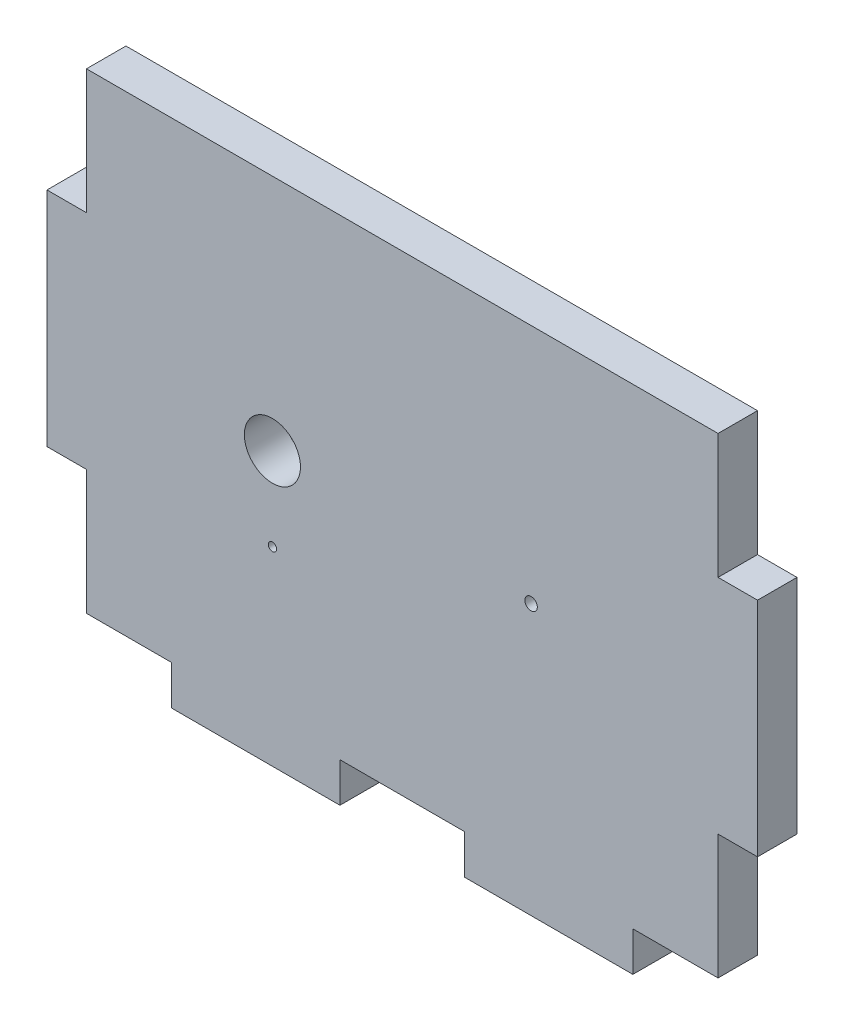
from build123d import *

# Parameters (mm, degrees)
ESQUISSE1_W                     = 342
ESQUISSE1_H                     = 246
BOSS_EXTRU_1_DEPTH              = 9.5
ENL_V_MAT_EXTRU_1_REACH         = 213.497
ESQUISSE2_W                     = 60
ESQUISSE2_H                     = 19
R_P_TITION_LIN_AIRE1_COUNT      = 3
R_P_TITION_LIN_AIRE1_PITCH      = 141
ENL_V_MAT_EXTRU_2_REACH         = 213.497
ESQUISSE3_W                     = 19
ESQUISSE3_H                     = 60
R_P_TITION_LIN_AIRE2_COUNT      = 2
R_P_TITION_LIN_AIRE2_PITCH      = 323
R_P_TITION_LIN_AIRE2_COUNT_DIR2 = 2
R_P_TITION_LIN_AIRE2_PITCH_DIR2 = 167
ENL_V_MAT_EXTRU_3_REACH         = 213.497
ESQUISSE4_R                     = 13.500583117
ESQUISSE4_R_2                   = 3
ESQUISSE4_R_3                   = 2


with BuildPart() as part:
    # Esquisse1 → Boss.-Extru.1 (new, symmetric)
    with BuildSketch(Plane.XY):
        Rectangle(ESQUISSE1_W, ESQUISSE1_H)
    extrude(amount=BOSS_EXTRU_1_DEPTH, both=True)

    # Esquisse2 → Enl_v. mat.-Extru.1 (cut, up to next)
    with BuildSketch(Plane.XY.offset(9.5), mode=Mode.PRIVATE) as enl_v_mat_extru_1_sk1:
        with Locations((141, -113.5)):
            Rectangle(ESQUISSE2_W, ESQUISSE2_H)
    enl_v_mat_extru_1_tool1 = extrude(enl_v_mat_extru_1_sk1.sketch, amount=-ENL_V_MAT_EXTRU_1_REACH, mode=Mode.PRIVATE) & part.part
    enl_v_mat_extru_1 = enl_v_mat_extru_1_tool1.solids().sort_by_distance((141, -113.5, 9.5))[0]
    add(enl_v_mat_extru_1, mode=Mode.SUBTRACT)

    # R_p_tition lin_aire1: Enl_v. mat.-Extru.1 ×3
    with Locations(*[(-i * R_P_TITION_LIN_AIRE1_PITCH, 0, 0) for i in range(1, R_P_TITION_LIN_AIRE1_COUNT)]):
        add(enl_v_mat_extru_1, mode=Mode.SUBTRACT)

    # Esquisse3 → Enl_v. mat.-Extru.2 (cut, up to next)
    with BuildSketch(Plane.XY.offset(9.5), mode=Mode.PRIVATE) as enl_v_mat_extru_2_sk1:
        with Locations((161.5, -74)):
            Rectangle(ESQUISSE3_W, ESQUISSE3_H)
    enl_v_mat_extru_2_tool1 = extrude(enl_v_mat_extru_2_sk1.sketch, amount=-ENL_V_MAT_EXTRU_2_REACH, mode=Mode.PRIVATE) & part.part
    enl_v_mat_extru_2 = enl_v_mat_extru_2_tool1.solids().sort_by_distance((161.5, -74, 9.5))[0]
    add(enl_v_mat_extru_2, mode=Mode.SUBTRACT)

    # R_p_tition lin_aire2: Enl_v. mat.-Extru.2 2 × 2
    with Locations(*[(-i * R_P_TITION_LIN_AIRE2_PITCH, j * R_P_TITION_LIN_AIRE2_PITCH_DIR2, 0) for i in range(R_P_TITION_LIN_AIRE2_COUNT) for j in range(R_P_TITION_LIN_AIRE2_COUNT_DIR2) if (i, j) != (0, 0)]):
        add(enl_v_mat_extru_2, mode=Mode.SUBTRACT)

    # Esquisse4 → Enl_v. mat.-Extru.3 (cut, up to next)
    with BuildSketch(Plane.XY.offset(9.5), mode=Mode.PRIVATE) as enl_v_mat_extru_3_sk1:
        with Locations((-62.504686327, 8.499416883)):
            Circle(ESQUISSE4_R)
    enl_v_mat_extru_3_tool1 = extrude(enl_v_mat_extru_3_sk1.sketch, amount=-ENL_V_MAT_EXTRU_3_REACH, mode=Mode.PRIVATE) & part.part
    # Esquisse4 → Enl_v. mat.-Extru.3 (cut, up to next)
    with BuildSketch(Plane.XY.offset(9.5), mode=Mode.PRIVATE) as enl_v_mat_extru_3_sk2:
        with Locations((62.006045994, 7.045738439)):
            Circle(ESQUISSE4_R_2)
    enl_v_mat_extru_3_tool2 = extrude(enl_v_mat_extru_3_sk2.sketch, amount=-ENL_V_MAT_EXTRU_3_REACH, mode=Mode.PRIVATE) & part.part
    # Esquisse4 → Enl_v. mat.-Extru.3 (cut, up to next)
    with BuildSketch(Plane.XY.offset(9.5), mode=Mode.PRIVATE) as enl_v_mat_extru_3_sk3:
        with Locations((-62.504686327, -31.500583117)):
            Circle(ESQUISSE4_R_3)
    enl_v_mat_extru_3_tool3 = extrude(enl_v_mat_extru_3_sk3.sketch, amount=-ENL_V_MAT_EXTRU_3_REACH, mode=Mode.PRIVATE) & part.part
    add(enl_v_mat_extru_3_tool1.solids().sort_by_distance((-62.504686, 8.499417, 9.5))[0], mode=Mode.SUBTRACT)
    add(enl_v_mat_extru_3_tool2.solids().sort_by_distance((62.006046, 7.045738, 9.5))[0], mode=Mode.SUBTRACT)
    add(enl_v_mat_extru_3_tool3.solids().sort_by_distance((-62.504686, -31.500583, 9.5))[0], mode=Mode.SUBTRACT)


solid = part.part
